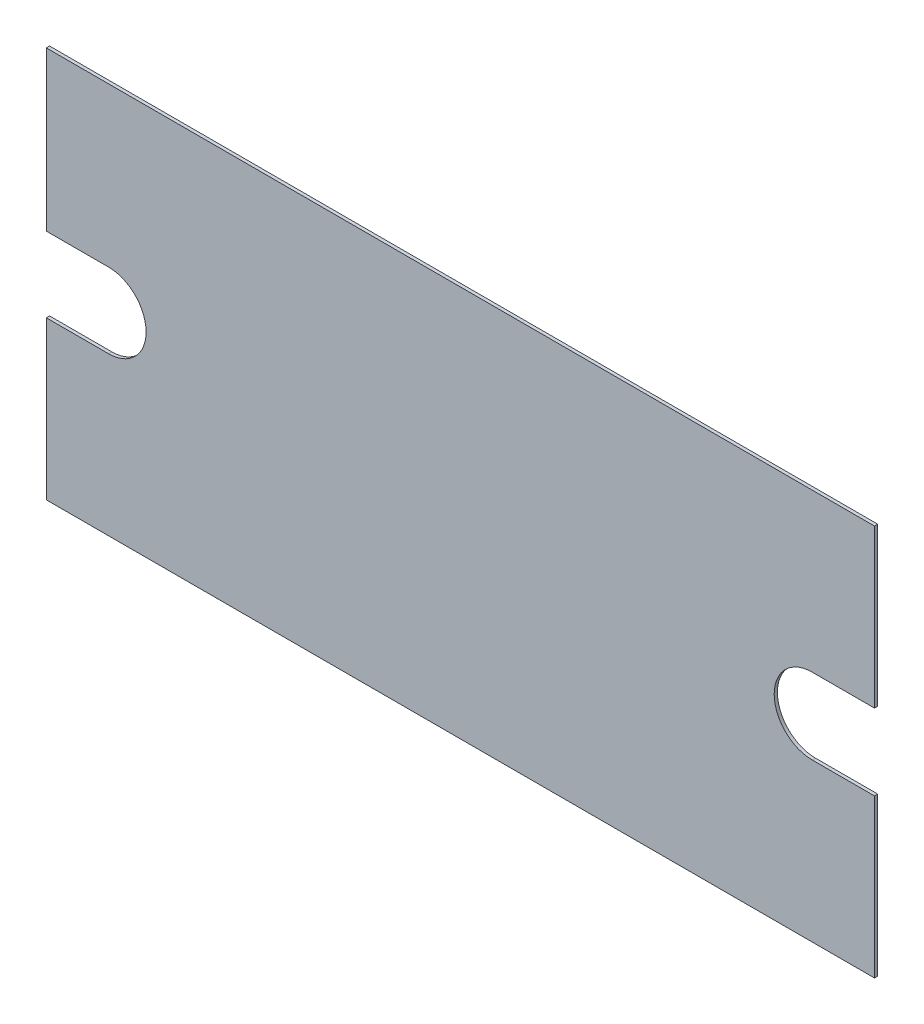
from build123d import *

# Parameters (mm, degrees)
P_IDAT_VYSUNUT_M1_DEPTH = 0.2


with BuildPart() as part:
    # Skica1 → P_idat vysunut_m1 (new body)
    with BuildSketch(Plane.XY):
        with BuildLine():
            Line((-24.267400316, 20.780011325), (16.459838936, 20.780011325))
            Line((16.459838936, 20.780011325), (16.459838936, 11.030011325))
            Line((16.459838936, 11.030011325), (12.609838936, 11.030011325))
            ThreePointArc((12.609838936, 11.030011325), (10.259838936, 8.680011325), (12.609838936, 6.330011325))
            Line((12.609838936, 6.330011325), (16.459838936, 6.330011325))
            Line((16.459838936, 6.330011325), (16.459838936, -3.419988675))
            Line((16.459838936, -3.419988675), (-34.740161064, -3.419988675))
            Line((-34.740161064, -3.419988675), (-34.740161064, 6.330011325))
            Line((-34.740161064, 6.330011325), (-30.890161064, 6.330011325))
            ThreePointArc((-30.890161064, 6.330011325), (-28.570802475, 8.649369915), (-30.890161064, 10.968728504))
            Line((-30.890161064, 10.968728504), (-34.740161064, 10.968728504))
            Line((-34.740161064, 10.968728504), (-34.740161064, 20.718728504))
            Line((-34.740161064, 20.718728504), (-34.740161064, 20.780011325))
            Line((-34.740161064, 20.780011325), (-24.267400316, 20.780011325))
        make_face()
    extrude(amount=P_IDAT_VYSUNUT_M1_DEPTH)


solid = part.part
